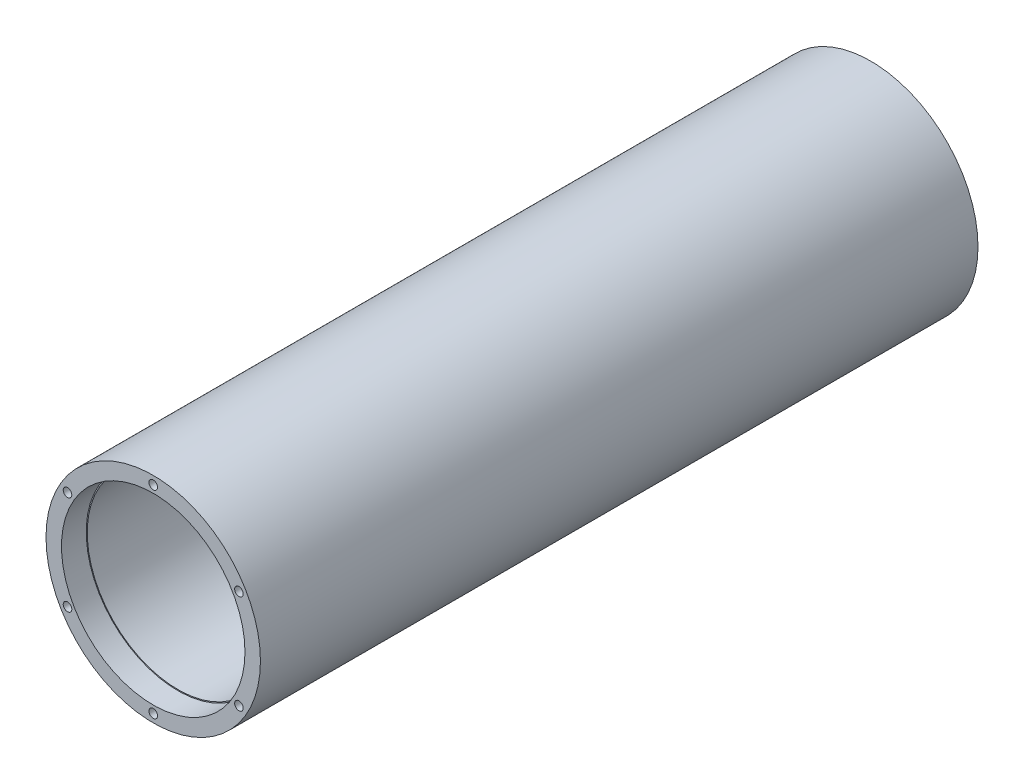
ISO-10303-21;
HEADER;
FILE_DESCRIPTION(('STEP AP214'),'2;1');
FILE_NAME('part.step','',(''),(''),'','','');
FILE_SCHEMA(('AUTOMOTIVE_DESIGN { 1 0 10303 214 1 1 1 1 }'));
ENDSEC;
DATA;
#1=APPLICATION_CONTEXT('core data for automotive mechanical design processes');
#2=APPLICATION_PROTOCOL_DEFINITION('international standard','automotive_design',2000,#1);
#3=PRODUCT_CONTEXT('',#1,'mechanical');
#4=PRODUCT('Part','Part','',(#3));
#5=PRODUCT_RELATED_PRODUCT_CATEGORY('part','',(#4));
#6=PRODUCT_DEFINITION_FORMATION('','',#4);
#7=PRODUCT_DEFINITION_CONTEXT('part definition',#1,'design');
#8=PRODUCT_DEFINITION('design','',#6,#7);
#9=PRODUCT_DEFINITION_SHAPE('','',#8);
#10=(LENGTH_UNIT() NAMED_UNIT(*) SI_UNIT(.MILLI.,.METRE.));
#11=(NAMED_UNIT(*) PLANE_ANGLE_UNIT() SI_UNIT($,.RADIAN.));
#12=(NAMED_UNIT(*) SI_UNIT($,.STERADIAN.) SOLID_ANGLE_UNIT());
#13=UNCERTAINTY_MEASURE_WITH_UNIT(LENGTH_MEASURE(1.E-05),#10,'distance_accuracy_value','');
#14=(GEOMETRIC_REPRESENTATION_CONTEXT(3) GLOBAL_UNCERTAINTY_ASSIGNED_CONTEXT((#13)) GLOBAL_UNIT_ASSIGNED_CONTEXT((#10,
#11,#12)) REPRESENTATION_CONTEXT('',''));
#15=CARTESIAN_POINT('',(0.,0.,0.));
#16=DIRECTION('',(0.,0.,1.));
#17=DIRECTION('',(1.,0.,0.));
#18=AXIS2_PLACEMENT_3D('',#15,#16,#17);
#19=CARTESIAN_POINT('',(0.,0.,577.85));
#20=DIRECTION('',(0.,0.,-1.));
#21=DIRECTION('',(-1.,0.,0.));
#22=AXIS2_PLACEMENT_3D('',#19,#20,#21);
#23=CYLINDRICAL_SURFACE('',#22,82.55);
#24=CARTESIAN_POINT('',(0.,0.,577.85));
#25=DIRECTION('',(0.,0.,1.));
#26=DIRECTION('',(1.,0.,0.));
#27=AXIS2_PLACEMENT_3D('',#24,#25,#26);
#28=CIRCLE('',#27,82.55);
#29=CARTESIAN_POINT('',(82.55,0.,577.85));
#30=VERTEX_POINT('',#29);
#31=EDGE_CURVE('E46',#30,#30,#28,.T.);
#32=ORIENTED_EDGE('',*,*,#31,.F.);
#33=EDGE_LOOP('',(#32));
#34=FACE_BOUND('',#33,.T.);
#35=CARTESIAN_POINT('',(0.,0.,25.4));
#36=DIRECTION('',(0.,0.,-1.));
#37=DIRECTION('',(-1.,0.,0.));
#38=AXIS2_PLACEMENT_3D('',#35,#36,#37);
#39=CIRCLE('',#38,82.55);
#40=CARTESIAN_POINT('',(-82.55,0.,25.4));
#41=VERTEX_POINT('',#40);
#42=EDGE_CURVE('E37',#41,#41,#39,.T.);
#43=ORIENTED_EDGE('',*,*,#42,.F.);
#44=EDGE_LOOP('',(#43));
#45=FACE_BOUND('',#44,.T.);
#46=ADVANCED_FACE('F34',(#34,#45),#23,.T.);
#47=CARTESIAN_POINT('',(0.,0.,0.));
#48=DIRECTION('',(0.,0.,1.));
#49=DIRECTION('',(1.,0.,0.));
#50=AXIS2_PLACEMENT_3D('',#47,#48,#49);
#51=PLANE('',#50);
#52=CARTESIAN_POINT('',(0.,0.,0.));
#53=DIRECTION('',(0.,0.,-1.));
#54=DIRECTION('',(-1.,0.,0.));
#55=AXIS2_PLACEMENT_3D('',#52,#53,#54);
#56=CIRCLE('',#55,7.62);
#57=CARTESIAN_POINT('',(-7.62,0.,0.));
#58=VERTEX_POINT('',#57);
#59=EDGE_CURVE('E56',#58,#58,#56,.T.);
#60=ORIENTED_EDGE('',*,*,#59,.F.);
#61=EDGE_LOOP('',(#60));
#62=FACE_BOUND('',#61,.T.);
#63=CARTESIAN_POINT('',(0.,0.,0.));
#64=DIRECTION('',(0.,0.,-1.));
#65=DIRECTION('',(-1.,0.,0.));
#66=AXIS2_PLACEMENT_3D('',#63,#64,#65);
#67=CIRCLE('',#66,38.1);
#68=CARTESIAN_POINT('',(-38.1,0.,0.));
#69=VERTEX_POINT('',#68);
#70=EDGE_CURVE('E377',#69,#69,#67,.T.);
#71=ORIENTED_EDGE('',*,*,#70,.T.);
#72=EDGE_LOOP('',(#71));
#73=FACE_BOUND('',#72,.T.);
#74=ADVANCED_FACE('F114',(#62,#73),#51,.F.);
#75=CARTESIAN_POINT('',(0.,0.,577.85));
#76=DIRECTION('',(0.,0.,1.));
#77=DIRECTION('',(1.,0.,0.));
#78=AXIS2_PLACEMENT_3D('',#75,#76,#77);
#79=PLANE('',#78);
#80=CARTESIAN_POINT('',(-65.9911357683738,38.1000000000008,577.85));
#81=DIRECTION('',(0.,0.,1.));
#82=DIRECTION('',(0.50000000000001,0.866025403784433,0.));
#83=AXIS2_PLACEMENT_3D('',#80,#81,#82);
#84=CIRCLE('',#83,3.302);
#85=CARTESIAN_POINT('',(-64.3401357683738,40.959615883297,577.85));
#86=VERTEX_POINT('',#85);
#87=EDGE_CURVE('E55',#86,#86,#84,.T.);
#88=ORIENTED_EDGE('',*,*,#87,.F.);
#89=EDGE_LOOP('',(#88));
#90=FACE_BOUND('',#89,.T.);
#91=CARTESIAN_POINT('',(-65.9911357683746,-38.0999999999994,577.85));
#92=DIRECTION('',(0.,0.,1.));
#93=DIRECTION('',(-0.499999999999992,0.866025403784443,0.));
#94=AXIS2_PLACEMENT_3D('',#91,#92,#93);
#95=CIRCLE('',#94,3.302);
#96=CARTESIAN_POINT('',(-67.6421357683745,-35.2403841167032,577.85));
#97=VERTEX_POINT('',#96);
#98=EDGE_CURVE('E73',#97,#97,#95,.T.);
#99=ORIENTED_EDGE('',*,*,#98,.F.);
#100=EDGE_LOOP('',(#99));
#101=FACE_BOUND('',#100,.T.);
#102=CARTESIAN_POINT('',(-5.3210206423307E-13,-76.2,577.85));
#103=DIRECTION('',(0.,0.,1.));
#104=DIRECTION('',(-1.,0.,0.));
#105=AXIS2_PLACEMENT_3D('',#102,#103,#104);
#106=CIRCLE('',#105,3.302);
#107=CARTESIAN_POINT('',(-3.30200000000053,-76.2,577.85));
#108=VERTEX_POINT('',#107);
#109=EDGE_CURVE('E79',#108,#108,#106,.T.);
#110=ORIENTED_EDGE('',*,*,#109,.F.);
#111=EDGE_LOOP('',(#110));
#112=FACE_BOUND('',#111,.T.);
#113=CARTESIAN_POINT('',(65.9911357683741,-38.1000000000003,577.85));
#114=DIRECTION('',(0.,0.,1.));
#115=DIRECTION('',(-0.500000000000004,-0.866025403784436,0.));
#116=AXIS2_PLACEMENT_3D('',#113,#114,#115);
#117=CIRCLE('',#116,3.302);
#118=CARTESIAN_POINT('',(64.3401357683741,-40.9596158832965,577.85));
#119=VERTEX_POINT('',#118);
#120=EDGE_CURVE('E85',#119,#119,#117,.T.);
#121=ORIENTED_EDGE('',*,*,#120,.F.);
#122=EDGE_LOOP('',(#121));
#123=FACE_BOUND('',#122,.T.);
#124=CARTESIAN_POINT('',(65.9911357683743,38.0999999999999,577.85));
#125=DIRECTION('',(0.,0.,1.));
#126=DIRECTION('',(0.499999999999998,-0.86602540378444,0.));
#127=AXIS2_PLACEMENT_3D('',#124,#125,#126);
#128=CIRCLE('',#127,3.302);
#129=CARTESIAN_POINT('',(67.6421357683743,35.2403841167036,577.85));
#130=VERTEX_POINT('',#129);
#131=EDGE_CURVE('E91',#130,#130,#128,.T.);
#132=ORIENTED_EDGE('',*,*,#131,.F.);
#133=EDGE_LOOP('',(#132));
#134=FACE_BOUND('',#133,.T.);
#135=CARTESIAN_POINT('',(0.,76.2,577.85));
#136=DIRECTION('',(0.,0.,1.));
#137=DIRECTION('',(1.,0.,0.));
#138=AXIS2_PLACEMENT_3D('',#135,#136,#137);
#139=CIRCLE('',#138,3.302);
#140=CARTESIAN_POINT('',(3.302,76.2,577.85));
#141=VERTEX_POINT('',#140);
#142=EDGE_CURVE('E97',#141,#141,#139,.T.);
#143=ORIENTED_EDGE('',*,*,#142,.F.);
#144=EDGE_LOOP('',(#143));
#145=FACE_BOUND('',#144,.T.);
#146=CARTESIAN_POINT('',(0.,0.,577.85));
#147=DIRECTION('',(0.,0.,1.));
#148=DIRECTION('',(1.,0.,0.));
#149=AXIS2_PLACEMENT_3D('',#146,#147,#148);
#150=CIRCLE('',#149,70.6374);
#151=CARTESIAN_POINT('',(70.6374,0.,577.85));
#152=VERTEX_POINT('',#151);
#153=EDGE_CURVE('E103',#152,#152,#150,.T.);
#154=ORIENTED_EDGE('',*,*,#153,.F.);
#155=EDGE_LOOP('',(#154));
#156=FACE_BOUND('',#155,.T.);
#157=ORIENTED_EDGE('',*,*,#31,.T.);
#158=EDGE_LOOP('',(#157));
#159=FACE_BOUND('',#158,.T.);
#160=ADVANCED_FACE('F110',(#90,#101,#112,#123,#134,#145,#156,#159),#79,.T.);
#161=CARTESIAN_POINT('',(0.,0.,558.8));
#162=DIRECTION('',(0.,0.,1.));
#163=DIRECTION('',(1.,0.,0.));
#164=AXIS2_PLACEMENT_3D('',#161,#162,#163);
#165=PLANE('',#164);
#166=CARTESIAN_POINT('',(0.,0.,558.8));
#167=DIRECTION('',(0.,0.,1.));
#168=DIRECTION('',(1.,0.,0.));
#169=AXIS2_PLACEMENT_3D('',#166,#167,#168);
#170=CIRCLE('',#169,70.6374);
#171=CARTESIAN_POINT('',(70.6374,0.,558.8));
#172=VERTEX_POINT('',#171);
#173=EDGE_CURVE('E52',#172,#172,#170,.T.);
#174=ORIENTED_EDGE('',*,*,#173,.T.);
#175=EDGE_LOOP('',(#174));
#176=FACE_BOUND('',#175,.T.);
#177=CARTESIAN_POINT('',(0.,0.,558.8));
#178=DIRECTION('',(0.,0.,1.));
#179=DIRECTION('',(1.,0.,0.));
#180=AXIS2_PLACEMENT_3D('',#177,#178,#179);
#181=CIRCLE('',#180,69.85);
#182=CARTESIAN_POINT('',(69.85,0.,558.8));
#183=VERTEX_POINT('',#182);
#184=EDGE_CURVE('E50',#183,#183,#181,.F.);
#185=ORIENTED_EDGE('',*,*,#184,.T.);
#186=EDGE_LOOP('',(#185));
#187=FACE_BOUND('',#186,.T.);
#188=ADVANCED_FACE('F181',(#176,#187),#165,.T.);
#189=CARTESIAN_POINT('',(0.,0.,558.8));
#190=DIRECTION('',(0.,0.,1.));
#191=DIRECTION('',(1.,0.,0.));
#192=AXIS2_PLACEMENT_3D('',#189,#190,#191);
#193=CYLINDRICAL_SURFACE('',#192,70.6374);
#194=CARTESIAN_POINT('',(70.6374,0.,558.8));
#195=CARTESIAN_POINT('',(70.6374,0.,558.9984375));
#196=CARTESIAN_POINT('',(70.6374,0.,559.196875));
#197=CARTESIAN_POINT('',(70.6374,0.,559.59375));
#198=CARTESIAN_POINT('',(70.6374,0.,559.7921875));
#199=CARTESIAN_POINT('',(70.6374,0.,560.1890625));
#200=CARTESIAN_POINT('',(70.6374,0.,560.3875));
#201=CARTESIAN_POINT('',(70.6374,0.,560.784375));
#202=CARTESIAN_POINT('',(70.6374,0.,560.9828125));
#203=CARTESIAN_POINT('',(70.6374,0.,561.3796875));
#204=CARTESIAN_POINT('',(70.6374,0.,561.578125));
#205=CARTESIAN_POINT('',(70.6374,0.,561.975));
#206=CARTESIAN_POINT('',(70.6374,0.,562.1734375));
#207=CARTESIAN_POINT('',(70.6374,0.,562.5703125));
#208=CARTESIAN_POINT('',(70.6374,0.,562.76875));
#209=CARTESIAN_POINT('',(70.6374,0.,563.165625));
#210=CARTESIAN_POINT('',(70.6374,0.,563.3640625));
#211=CARTESIAN_POINT('',(70.6374,0.,563.7609375));
#212=CARTESIAN_POINT('',(70.6374,0.,563.959375));
#213=CARTESIAN_POINT('',(70.6374,0.,564.35625));
#214=CARTESIAN_POINT('',(70.6374,0.,564.5546875));
#215=CARTESIAN_POINT('',(70.6374,0.,564.9515625));
#216=CARTESIAN_POINT('',(70.6374,0.,565.15));
#217=CARTESIAN_POINT('',(70.6374,0.,565.546875));
#218=CARTESIAN_POINT('',(70.6374,0.,565.7453125));
#219=CARTESIAN_POINT('',(70.6374,0.,566.1421875));
#220=CARTESIAN_POINT('',(70.6374,0.,566.340625));
#221=CARTESIAN_POINT('',(70.6374,0.,566.7375));
#222=CARTESIAN_POINT('',(70.6374,0.,566.9359375));
#223=CARTESIAN_POINT('',(70.6374,0.,567.3328125));
#224=CARTESIAN_POINT('',(70.6374,0.,567.53125));
#225=CARTESIAN_POINT('',(70.6374,0.,567.928125));
#226=CARTESIAN_POINT('',(70.6374,0.,568.1265625));
#227=CARTESIAN_POINT('',(70.6374,0.,568.5234375));
#228=CARTESIAN_POINT('',(70.6374,0.,568.721875));
#229=CARTESIAN_POINT('',(70.6374,0.,569.11875));
#230=CARTESIAN_POINT('',(70.6374,0.,569.3171875));
#231=CARTESIAN_POINT('',(70.6374,0.,569.7140625));
#232=CARTESIAN_POINT('',(70.6374,0.,569.9125));
#233=CARTESIAN_POINT('',(70.6374,0.,570.309375));
#234=CARTESIAN_POINT('',(70.6374,0.,570.5078125));
#235=CARTESIAN_POINT('',(70.6374,0.,570.9046875));
#236=CARTESIAN_POINT('',(70.6374,0.,571.103125));
#237=CARTESIAN_POINT('',(70.6374,0.,571.5));
#238=CARTESIAN_POINT('',(70.6374,0.,571.6984375));
#239=CARTESIAN_POINT('',(70.6374,0.,572.0953125));
#240=CARTESIAN_POINT('',(70.6374,0.,572.29375));
#241=CARTESIAN_POINT('',(70.6374,0.,572.690625));
#242=CARTESIAN_POINT('',(70.6374,0.,572.8890625));
#243=CARTESIAN_POINT('',(70.6374,0.,573.2859375));
#244=CARTESIAN_POINT('',(70.6374,0.,573.484375));
#245=CARTESIAN_POINT('',(70.6374,0.,573.88125));
#246=CARTESIAN_POINT('',(70.6374,0.,574.0796875));
#247=CARTESIAN_POINT('',(70.6374,0.,574.4765625));
#248=CARTESIAN_POINT('',(70.6374,0.,574.675));
#249=CARTESIAN_POINT('',(70.6374,0.,575.071875));
#250=CARTESIAN_POINT('',(70.6374,0.,575.2703125));
#251=CARTESIAN_POINT('',(70.6374,0.,575.6671875));
#252=CARTESIAN_POINT('',(70.6374,0.,575.865625));
#253=CARTESIAN_POINT('',(70.6374,0.,576.2625));
#254=CARTESIAN_POINT('',(70.6374,0.,576.4609375));
#255=CARTESIAN_POINT('',(70.6374,0.,576.8578125));
#256=CARTESIAN_POINT('',(70.6374,0.,577.05625));
#257=CARTESIAN_POINT('',(70.6374,0.,577.453125));
#258=CARTESIAN_POINT('',(70.6374,0.,577.6515625));
#259=CARTESIAN_POINT('',(70.6374,0.,577.85));
#260=B_SPLINE_CURVE_WITH_KNOTS('',3,(#194,#195,#196,#197,#198,#199,#200,#201,#202,#203,#204,
#205,#206,#207,#208,#209,#210,#211,#212,#213,#214,#215,#216,#217,#218,#219,#220,#221,#222,#223,
#224,#225,#226,#227,#228,#229,#230,#231,#232,#233,#234,#235,#236,#237,#238,#239,#240,#241,#242,
#243,#244,#245,#246,#247,#248,#249,#250,#251,#252,#253,#254,#255,#256,#257,#258,#259),
.UNSPECIFIED.,.F.,.F.,(4,2,2,2,2,2,2,2,2,2,2,2,2,2,2,2,2,2,2,2,2,2,2,2,2,2,2,2,2,2,2,2,4),(0.,
0.5953125,1.190625,1.7859375,2.38125,2.9765625,3.571875,4.1671875,4.7625,5.3578125,5.953125,
6.5484375,7.14375,7.7390625,8.334375,8.92968750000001,9.52500000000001,10.1203125,10.715625,
11.3109375,11.90625,12.5015625,13.096875,13.6921875,14.2875,14.8828125,15.478125,16.0734375,
16.66875,17.2640625,17.859375,18.4546875,19.05),.UNSPECIFIED.);
#261=EDGE_CURVE('BSEAM184',#172,#152,#260,.T.);
#262=ORIENTED_EDGE('',*,*,#173,.F.);
#263=ORIENTED_EDGE('',*,*,#153,.T.);
#264=ORIENTED_EDGE('',*,*,#261,.T.);
#265=ORIENTED_EDGE('',*,*,#261,.F.);
#266=EDGE_LOOP('',(#262,#264,#263,#265));
#267=FACE_BOUND('',#266,.T.);
#268=ADVANCED_FACE('F184',(#267),#193,.F.);
#269=CARTESIAN_POINT('',(0.,0.,69.85));
#270=DIRECTION('',(0.,0.,1.));
#271=DIRECTION('',(1.,0.,0.));
#272=AXIS2_PLACEMENT_3D('',#269,#270,#271);
#273=PLANE('',#272);
#274=CARTESIAN_POINT('',(0.,0.,69.85));
#275=DIRECTION('',(0.,0.,1.));
#276=DIRECTION('',(1.,0.,0.));
#277=AXIS2_PLACEMENT_3D('',#274,#275,#276);
#278=CIRCLE('',#277,7.62);
#279=CARTESIAN_POINT('',(7.62,0.,69.85));
#280=VERTEX_POINT('',#279);
#281=EDGE_CURVE('E53',#280,#280,#278,.T.);
#282=ORIENTED_EDGE('',*,*,#281,.F.);
#283=EDGE_LOOP('',(#282));
#284=FACE_BOUND('',#283,.T.);
#285=CARTESIAN_POINT('',(0.,0.,69.85));
#286=DIRECTION('',(0.,0.,1.));
#287=DIRECTION('',(1.,0.,0.));
#288=AXIS2_PLACEMENT_3D('',#285,#286,#287);
#289=CIRCLE('',#288,63.5);
#290=CARTESIAN_POINT('',(63.5,0.,69.85));
#291=VERTEX_POINT('',#290);
#292=EDGE_CURVE('E41',#291,#291,#289,.T.);
#293=ORIENTED_EDGE('',*,*,#292,.T.);
#294=EDGE_LOOP('',(#293));
#295=FACE_BOUND('',#294,.T.);
#296=ADVANCED_FACE('F188',(#284,#295),#273,.T.);
#297=CARTESIAN_POINT('',(0.,0.,76.2));
#298=DIRECTION('',(0.,0.,1.));
#299=DIRECTION('',(1.,0.,0.));
#300=AXIS2_PLACEMENT_3D('',#297,#298,#299);
#301=TOROIDAL_SURFACE('',#300,63.5,6.35);
#302=CARTESIAN_POINT('',(0.,0.,76.2));
#303=DIRECTION('',(0.,0.,1.));
#304=DIRECTION('',(1.,0.,0.));
#305=AXIS2_PLACEMENT_3D('',#302,#303,#304);
#306=CIRCLE('',#305,69.85);
#307=CARTESIAN_POINT('',(69.85,0.,76.2));
#308=VERTEX_POINT('',#307);
#309=EDGE_CURVE('E10',#308,#308,#306,.F.);
#310=ORIENTED_EDGE('',*,*,#309,.F.);
#311=EDGE_LOOP('',(#310));
#312=FACE_BOUND('',#311,.T.);
#313=ORIENTED_EDGE('',*,*,#292,.F.);
#314=EDGE_LOOP('',(#313));
#315=FACE_BOUND('',#314,.T.);
#316=ADVANCED_FACE('F190',(#312,#315),#301,.F.);
#317=CARTESIAN_POINT('',(0.,0.,69.85));
#318=DIRECTION('',(0.,0.,1.));
#319=DIRECTION('',(1.,0.,0.));
#320=AXIS2_PLACEMENT_3D('',#317,#318,#319);
#321=CYLINDRICAL_SURFACE('',#320,69.85);
#322=ORIENTED_EDGE('',*,*,#309,.T.);
#323=EDGE_LOOP('',(#322));
#324=FACE_BOUND('',#323,.T.);
#325=ORIENTED_EDGE('',*,*,#184,.F.);
#326=EDGE_LOOP('',(#325));
#327=FACE_BOUND('',#326,.T.);
#328=ADVANCED_FACE('F179',(#324,#327),#321,.F.);
#329=CARTESIAN_POINT('',(0.,76.2,552.45));
#330=DIRECTION('',(0.,0.,1.));
#331=DIRECTION('',(1.,0.,0.));
#332=AXIS2_PLACEMENT_3D('',#329,#330,#331);
#333=CYLINDRICAL_SURFACE('',#332,3.302);
#334=CARTESIAN_POINT('',(0.,76.2,552.45));
#335=DIRECTION('',(0.,0.,1.));
#336=DIRECTION('',(1.,0.,0.));
#337=AXIS2_PLACEMENT_3D('',#334,#335,#336);
#338=CIRCLE('',#337,3.302);
#339=CARTESIAN_POINT('',(3.302,76.2,552.45));
#340=VERTEX_POINT('',#339);
#341=EDGE_CURVE('E100',#340,#340,#338,.T.);
#342=ORIENTED_EDGE('',*,*,#341,.F.);
#343=EDGE_LOOP('',(#342));
#344=FACE_BOUND('',#343,.T.);
#345=ORIENTED_EDGE('',*,*,#142,.T.);
#346=EDGE_LOOP('',(#345));
#347=FACE_BOUND('',#346,.T.);
#348=ADVANCED_FACE('F175',(#344,#347),#333,.F.);
#349=CARTESIAN_POINT('',(0.,76.2,552.45));
#350=DIRECTION('',(0.,0.,1.));
#351=DIRECTION('',(1.,0.,0.));
#352=AXIS2_PLACEMENT_3D('',#349,#350,#351);
#353=PLANE('',#352);
#354=ORIENTED_EDGE('',*,*,#341,.T.);
#355=EDGE_LOOP('',(#354));
#356=FACE_BOUND('',#355,.T.);
#357=ADVANCED_FACE('F171',(#356),#353,.T.);
#358=CARTESIAN_POINT('',(65.9911357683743,38.0999999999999,552.45));
#359=DIRECTION('',(0.,0.,1.));
#360=DIRECTION('',(1.,0.,0.));
#361=AXIS2_PLACEMENT_3D('',#358,#359,#360);
#362=CYLINDRICAL_SURFACE('',#361,3.302);
#363=CARTESIAN_POINT('',(65.9911357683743,38.0999999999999,552.45));
#364=DIRECTION('',(0.,0.,1.));
#365=DIRECTION('',(0.499999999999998,-0.86602540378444,0.));
#366=AXIS2_PLACEMENT_3D('',#363,#364,#365);
#367=CIRCLE('',#366,3.302);
#368=CARTESIAN_POINT('',(67.6421357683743,35.2403841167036,552.45));
#369=VERTEX_POINT('',#368);
#370=EDGE_CURVE('E94',#369,#369,#367,.T.);
#371=ORIENTED_EDGE('',*,*,#370,.F.);
#372=EDGE_LOOP('',(#371));
#373=FACE_BOUND('',#372,.T.);
#374=ORIENTED_EDGE('',*,*,#131,.T.);
#375=EDGE_LOOP('',(#374));
#376=FACE_BOUND('',#375,.T.);
#377=ADVANCED_FACE('F167',(#373,#376),#362,.F.);
#378=CARTESIAN_POINT('',(65.9911357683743,38.0999999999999,552.45));
#379=DIRECTION('',(0.,0.,1.));
#380=DIRECTION('',(0.499999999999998,-0.86602540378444,0.));
#381=AXIS2_PLACEMENT_3D('',#378,#379,#380);
#382=PLANE('',#381);
#383=ORIENTED_EDGE('',*,*,#370,.T.);
#384=EDGE_LOOP('',(#383));
#385=FACE_BOUND('',#384,.T.);
#386=ADVANCED_FACE('F163',(#385),#382,.T.);
#387=CARTESIAN_POINT('',(65.9911357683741,-38.1000000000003,552.45));
#388=DIRECTION('',(0.,0.,1.));
#389=DIRECTION('',(1.,0.,0.));
#390=AXIS2_PLACEMENT_3D('',#387,#388,#389);
#391=CYLINDRICAL_SURFACE('',#390,3.302);
#392=CARTESIAN_POINT('',(65.9911357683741,-38.1000000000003,552.45));
#393=DIRECTION('',(0.,0.,1.));
#394=DIRECTION('',(-0.500000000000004,-0.866025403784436,0.));
#395=AXIS2_PLACEMENT_3D('',#392,#393,#394);
#396=CIRCLE('',#395,3.302);
#397=CARTESIAN_POINT('',(64.3401357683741,-40.9596158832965,552.45));
#398=VERTEX_POINT('',#397);
#399=EDGE_CURVE('E88',#398,#398,#396,.T.);
#400=ORIENTED_EDGE('',*,*,#399,.F.);
#401=EDGE_LOOP('',(#400));
#402=FACE_BOUND('',#401,.T.);
#403=ORIENTED_EDGE('',*,*,#120,.T.);
#404=EDGE_LOOP('',(#403));
#405=FACE_BOUND('',#404,.T.);
#406=ADVANCED_FACE('F159',(#402,#405),#391,.F.);
#407=CARTESIAN_POINT('',(65.9911357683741,-38.1000000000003,552.45));
#408=DIRECTION('',(0.,0.,1.));
#409=DIRECTION('',(-0.500000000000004,-0.866025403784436,0.));
#410=AXIS2_PLACEMENT_3D('',#407,#408,#409);
#411=PLANE('',#410);
#412=ORIENTED_EDGE('',*,*,#399,.T.);
#413=EDGE_LOOP('',(#412));
#414=FACE_BOUND('',#413,.T.);
#415=ADVANCED_FACE('F155',(#414),#411,.T.);
#416=CARTESIAN_POINT('',(-5.3210206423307E-13,-76.2,552.45));
#417=DIRECTION('',(0.,0.,1.));
#418=DIRECTION('',(1.,0.,0.));
#419=AXIS2_PLACEMENT_3D('',#416,#417,#418);
#420=CYLINDRICAL_SURFACE('',#419,3.302);
#421=CARTESIAN_POINT('',(-5.3210206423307E-13,-76.2,552.45));
#422=DIRECTION('',(0.,0.,1.));
#423=DIRECTION('',(-1.,0.,0.));
#424=AXIS2_PLACEMENT_3D('',#421,#422,#423);
#425=CIRCLE('',#424,3.302);
#426=CARTESIAN_POINT('',(-3.30200000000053,-76.2,552.45));
#427=VERTEX_POINT('',#426);
#428=EDGE_CURVE('E82',#427,#427,#425,.T.);
#429=ORIENTED_EDGE('',*,*,#428,.F.);
#430=EDGE_LOOP('',(#429));
#431=FACE_BOUND('',#430,.T.);
#432=ORIENTED_EDGE('',*,*,#109,.T.);
#433=EDGE_LOOP('',(#432));
#434=FACE_BOUND('',#433,.T.);
#435=ADVANCED_FACE('F151',(#431,#434),#420,.F.);
#436=CARTESIAN_POINT('',(-5.3210206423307E-13,-76.2,552.45));
#437=DIRECTION('',(0.,0.,1.));
#438=DIRECTION('',(-1.,0.,0.));
#439=AXIS2_PLACEMENT_3D('',#436,#437,#438);
#440=PLANE('',#439);
#441=ORIENTED_EDGE('',*,*,#428,.T.);
#442=EDGE_LOOP('',(#441));
#443=FACE_BOUND('',#442,.T.);
#444=ADVANCED_FACE('F147',(#443),#440,.T.);
#445=CARTESIAN_POINT('',(-65.9911357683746,-38.0999999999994,552.45));
#446=DIRECTION('',(0.,0.,1.));
#447=DIRECTION('',(1.,0.,0.));
#448=AXIS2_PLACEMENT_3D('',#445,#446,#447);
#449=CYLINDRICAL_SURFACE('',#448,3.302);
#450=CARTESIAN_POINT('',(-65.9911357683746,-38.0999999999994,552.45));
#451=DIRECTION('',(0.,0.,1.));
#452=DIRECTION('',(-0.499999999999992,0.866025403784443,0.));
#453=AXIS2_PLACEMENT_3D('',#450,#451,#452);
#454=CIRCLE('',#453,3.302);
#455=CARTESIAN_POINT('',(-67.6421357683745,-35.2403841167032,552.45));
#456=VERTEX_POINT('',#455);
#457=EDGE_CURVE('E76',#456,#456,#454,.T.);
#458=ORIENTED_EDGE('',*,*,#457,.F.);
#459=EDGE_LOOP('',(#458));
#460=FACE_BOUND('',#459,.T.);
#461=ORIENTED_EDGE('',*,*,#98,.T.);
#462=EDGE_LOOP('',(#461));
#463=FACE_BOUND('',#462,.T.);
#464=ADVANCED_FACE('F143',(#460,#463),#449,.F.);
#465=CARTESIAN_POINT('',(-65.9911357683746,-38.0999999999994,552.45));
#466=DIRECTION('',(0.,0.,1.));
#467=DIRECTION('',(-0.499999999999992,0.866025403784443,0.));
#468=AXIS2_PLACEMENT_3D('',#465,#466,#467);
#469=PLANE('',#468);
#470=ORIENTED_EDGE('',*,*,#457,.T.);
#471=EDGE_LOOP('',(#470));
#472=FACE_BOUND('',#471,.T.);
#473=ADVANCED_FACE('F139',(#472),#469,.T.);
#474=CARTESIAN_POINT('',(-65.9911357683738,38.1000000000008,552.45));
#475=DIRECTION('',(0.,0.,1.));
#476=DIRECTION('',(1.,0.,0.));
#477=AXIS2_PLACEMENT_3D('',#474,#475,#476);
#478=CYLINDRICAL_SURFACE('',#477,3.302);
#479=CARTESIAN_POINT('',(-65.9911357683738,38.1000000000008,552.45));
#480=DIRECTION('',(0.,0.,1.));
#481=DIRECTION('',(0.50000000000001,0.866025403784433,0.));
#482=AXIS2_PLACEMENT_3D('',#479,#480,#481);
#483=CIRCLE('',#482,3.302);
#484=CARTESIAN_POINT('',(-64.3401357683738,40.959615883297,552.45));
#485=VERTEX_POINT('',#484);
#486=EDGE_CURVE('E60',#485,#485,#483,.T.);
#487=ORIENTED_EDGE('',*,*,#486,.F.);
#488=EDGE_LOOP('',(#487));
#489=FACE_BOUND('',#488,.T.);
#490=ORIENTED_EDGE('',*,*,#87,.T.);
#491=EDGE_LOOP('',(#490));
#492=FACE_BOUND('',#491,.T.);
#493=ADVANCED_FACE('F135',(#489,#492),#478,.F.);
#494=CARTESIAN_POINT('',(-65.9911357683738,38.1000000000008,552.45));
#495=DIRECTION('',(0.,0.,1.));
#496=DIRECTION('',(0.50000000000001,0.866025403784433,0.));
#497=AXIS2_PLACEMENT_3D('',#494,#495,#496);
#498=PLANE('',#497);
#499=ORIENTED_EDGE('',*,*,#486,.T.);
#500=EDGE_LOOP('',(#499));
#501=FACE_BOUND('',#500,.T.);
#502=ADVANCED_FACE('F129',(#501),#498,.T.);
#503=CARTESIAN_POINT('',(0.,0.,577.85));
#504=DIRECTION('',(0.,0.,-1.));
#505=DIRECTION('',(-1.,0.,0.));
#506=AXIS2_PLACEMENT_3D('',#503,#504,#505);
#507=CYLINDRICAL_SURFACE('',#506,7.62);
#508=ORIENTED_EDGE('',*,*,#281,.T.);
#509=EDGE_LOOP('',(#508));
#510=FACE_BOUND('',#509,.T.);
#511=ORIENTED_EDGE('',*,*,#59,.T.);
#512=EDGE_LOOP('',(#511));
#513=FACE_BOUND('',#512,.T.);
#514=ADVANCED_FACE('F120',(#510,#513),#507,.F.);
#515=CARTESIAN_POINT('',(0.,0.,25.4));
#516=DIRECTION('',(0.,0.,-1.));
#517=DIRECTION('',(-1.,0.,0.));
#518=AXIS2_PLACEMENT_3D('',#515,#516,#517);
#519=PLANE('',#518);
#520=CARTESIAN_POINT('',(0.,0.,25.4));
#521=DIRECTION('',(0.,0.,-1.));
#522=DIRECTION('',(-1.,0.,0.));
#523=AXIS2_PLACEMENT_3D('',#520,#521,#522);
#524=CIRCLE('',#523,38.1);
#525=CARTESIAN_POINT('',(-38.1,0.,25.4));
#526=VERTEX_POINT('',#525);
#527=EDGE_CURVE('E67',#526,#526,#524,.T.);
#528=ORIENTED_EDGE('',*,*,#527,.F.);
#529=EDGE_LOOP('',(#528));
#530=FACE_BOUND('',#529,.T.);
#531=ORIENTED_EDGE('',*,*,#42,.T.);
#532=EDGE_LOOP('',(#531));
#533=FACE_BOUND('',#532,.T.);
#534=ADVANCED_FACE('F117',(#530,#533),#519,.T.);
#535=CARTESIAN_POINT('',(0.,0.,25.4));
#536=DIRECTION('',(0.,0.,-1.));
#537=DIRECTION('',(-1.,0.,0.));
#538=AXIS2_PLACEMENT_3D('',#535,#536,#537);
#539=CYLINDRICAL_SURFACE('',#538,38.1);
#540=ORIENTED_EDGE('',*,*,#527,.T.);
#541=EDGE_LOOP('',(#540));
#542=FACE_BOUND('',#541,.T.);
#543=ORIENTED_EDGE('',*,*,#70,.F.);
#544=EDGE_LOOP('',(#543));
#545=FACE_BOUND('',#544,.T.);
#546=ADVANCED_FACE('F119',(#542,#545),#539,.T.);
#547=CLOSED_SHELL('',(#46,#74,#160,#188,#268,#296,#316,#328,#348,#357,#377,#386,#406,#415,#435,
#444,#464,#473,#493,#502,#514,#534,#546));
#548=MANIFOLD_SOLID_BREP('B2',#547);
#549=ADVANCED_BREP_SHAPE_REPRESENTATION('',(#18,#548),#14);
#550=SHAPE_DEFINITION_REPRESENTATION(#9,#549);
ENDSEC;
END-ISO-10303-21;
